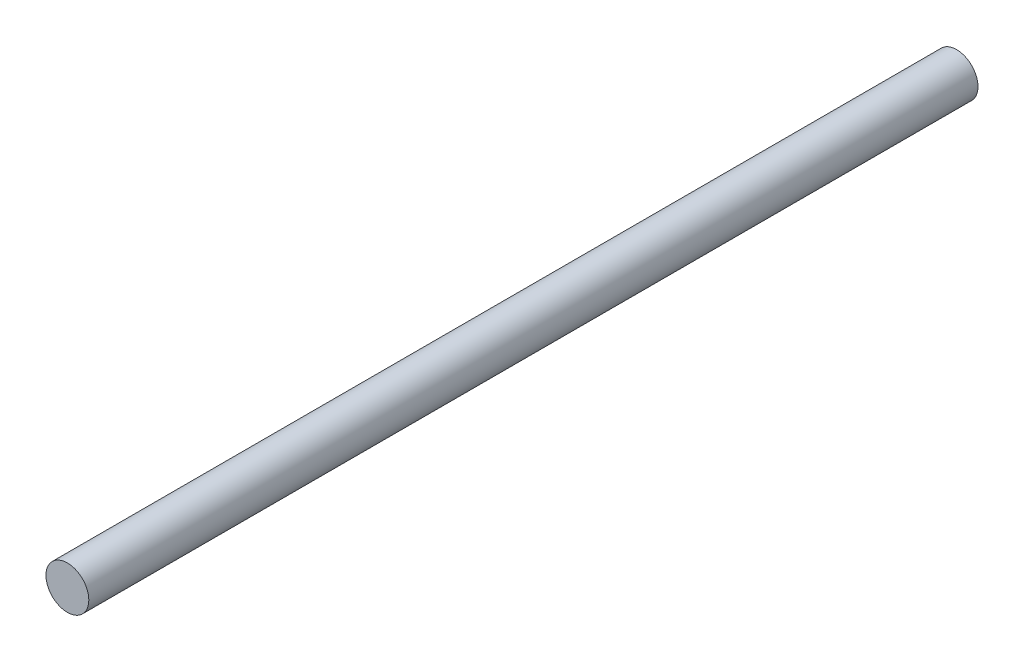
ISO-10303-21;
HEADER;
FILE_DESCRIPTION(('STEP AP214'),'2;1');
FILE_NAME('part.step','',(''),(''),'','','');
FILE_SCHEMA(('AUTOMOTIVE_DESIGN { 1 0 10303 214 1 1 1 1 }'));
ENDSEC;
DATA;
#1=APPLICATION_CONTEXT('core data for automotive mechanical design processes');
#2=APPLICATION_PROTOCOL_DEFINITION('international standard','automotive_design',2000,#1);
#3=PRODUCT_CONTEXT('',#1,'mechanical');
#4=PRODUCT('Part','Part','',(#3));
#5=PRODUCT_RELATED_PRODUCT_CATEGORY('part','',(#4));
#6=PRODUCT_DEFINITION_FORMATION('','',#4);
#7=PRODUCT_DEFINITION_CONTEXT('part definition',#1,'design');
#8=PRODUCT_DEFINITION('design','',#6,#7);
#9=PRODUCT_DEFINITION_SHAPE('','',#8);
#10=(LENGTH_UNIT() NAMED_UNIT(*) SI_UNIT(.MILLI.,.METRE.));
#11=(NAMED_UNIT(*) PLANE_ANGLE_UNIT() SI_UNIT($,.RADIAN.));
#12=(NAMED_UNIT(*) SI_UNIT($,.STERADIAN.) SOLID_ANGLE_UNIT());
#13=UNCERTAINTY_MEASURE_WITH_UNIT(LENGTH_MEASURE(1.E-05),#10,'distance_accuracy_value','');
#14=(GEOMETRIC_REPRESENTATION_CONTEXT(3) GLOBAL_UNCERTAINTY_ASSIGNED_CONTEXT((#13)) GLOBAL_UNIT_ASSIGNED_CONTEXT((#10,
#11,#12)) REPRESENTATION_CONTEXT('',''));
#15=CARTESIAN_POINT('',(0.,0.,0.));
#16=DIRECTION('',(0.,0.,1.));
#17=DIRECTION('',(1.,0.,0.));
#18=AXIS2_PLACEMENT_3D('',#15,#16,#17);
#19=CARTESIAN_POINT('',(0.,0.,16.6));
#20=DIRECTION('',(0.,0.,-1.));
#21=DIRECTION('',(-1.,0.,0.));
#22=AXIS2_PLACEMENT_3D('',#19,#20,#21);
#23=CYLINDRICAL_SURFACE('',#22,0.4);
#24=CARTESIAN_POINT('',(0.,0.,16.6));
#25=DIRECTION('',(0.,0.,1.));
#26=DIRECTION('',(1.,0.,0.));
#27=AXIS2_PLACEMENT_3D('',#24,#25,#26);
#28=CIRCLE('',#27,0.4);
#29=CARTESIAN_POINT('',(0.4,0.,16.6));
#30=VERTEX_POINT('',#29);
#31=EDGE_CURVE('E10',#30,#30,#28,.T.);
#32=ORIENTED_EDGE('',*,*,#31,.F.);
#33=EDGE_LOOP('',(#32));
#34=FACE_BOUND('',#33,.T.);
#35=CARTESIAN_POINT('',(0.,0.,0.));
#36=DIRECTION('',(0.,0.,1.));
#37=DIRECTION('',(1.,0.,0.));
#38=AXIS2_PLACEMENT_3D('',#35,#36,#37);
#39=CIRCLE('',#38,0.4);
#40=CARTESIAN_POINT('',(0.4,0.,0.));
#41=VERTEX_POINT('',#40);
#42=EDGE_CURVE('E31',#41,#41,#39,.T.);
#43=ORIENTED_EDGE('',*,*,#42,.T.);
#44=EDGE_LOOP('',(#43));
#45=FACE_BOUND('',#44,.T.);
#46=ADVANCED_FACE('F28',(#34,#45),#23,.T.);
#47=CARTESIAN_POINT('',(0.,0.,16.6));
#48=DIRECTION('',(0.,0.,1.));
#49=DIRECTION('',(1.,0.,0.));
#50=AXIS2_PLACEMENT_3D('',#47,#48,#49);
#51=PLANE('',#50);
#52=ORIENTED_EDGE('',*,*,#31,.T.);
#53=EDGE_LOOP('',(#52));
#54=FACE_BOUND('',#53,.T.);
#55=ADVANCED_FACE('F43',(#54),#51,.T.);
#56=CARTESIAN_POINT('',(0.,0.,0.));
#57=DIRECTION('',(0.,0.,1.));
#58=DIRECTION('',(1.,0.,0.));
#59=AXIS2_PLACEMENT_3D('',#56,#57,#58);
#60=PLANE('',#59);
#61=ORIENTED_EDGE('',*,*,#42,.F.);
#62=EDGE_LOOP('',(#61));
#63=FACE_BOUND('',#62,.T.);
#64=ADVANCED_FACE('F41',(#63),#60,.F.);
#65=CLOSED_SHELL('',(#46,#55,#64));
#66=MANIFOLD_SOLID_BREP('B2',#65);
#67=ADVANCED_BREP_SHAPE_REPRESENTATION('',(#18,#66),#14);
#68=SHAPE_DEFINITION_REPRESENTATION(#9,#67);
ENDSEC;
END-ISO-10303-21;
